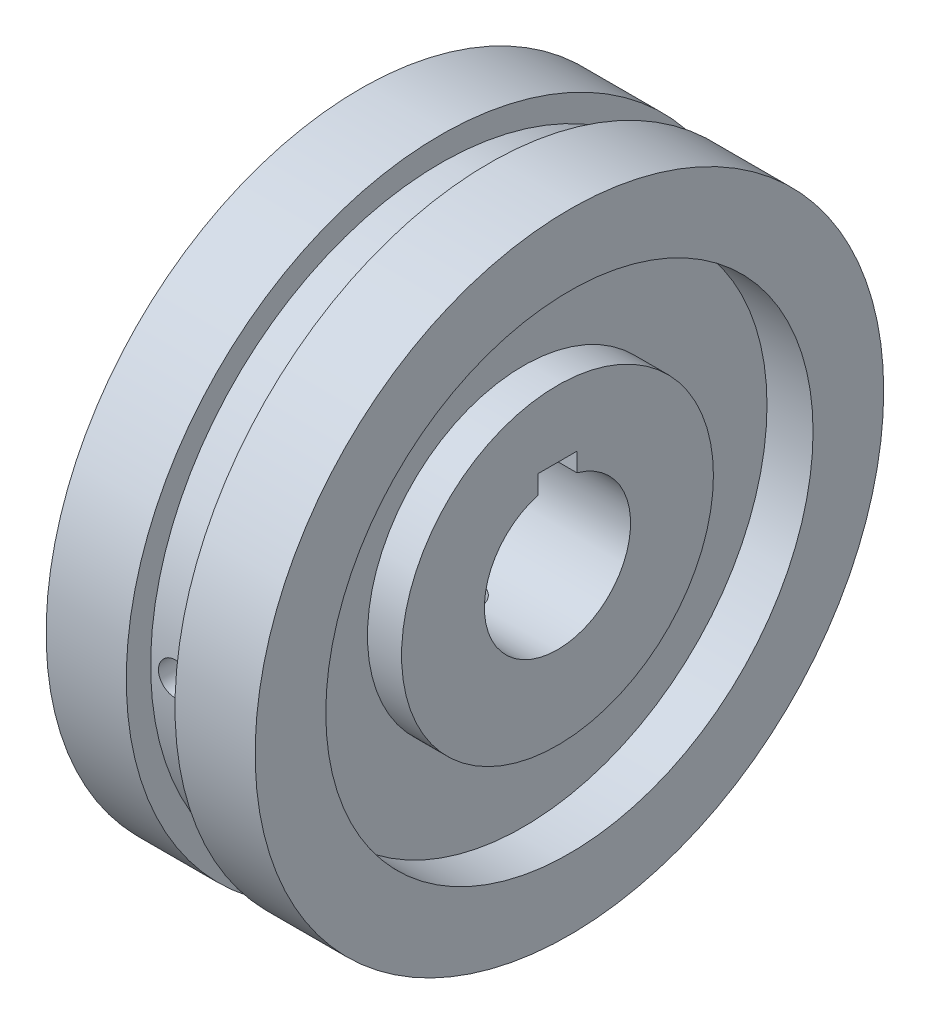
ISO-10303-21;
HEADER;
FILE_DESCRIPTION(('STEP AP214'),'2;1');
FILE_NAME('part.step','',(''),(''),'','','');
FILE_SCHEMA(('AUTOMOTIVE_DESIGN { 1 0 10303 214 1 1 1 1 }'));
ENDSEC;
DATA;
#1=APPLICATION_CONTEXT('core data for automotive mechanical design processes');
#2=APPLICATION_PROTOCOL_DEFINITION('international standard','automotive_design',2000,#1);
#3=PRODUCT_CONTEXT('',#1,'mechanical');
#4=PRODUCT('Part','Part','',(#3));
#5=PRODUCT_RELATED_PRODUCT_CATEGORY('part','',(#4));
#6=PRODUCT_DEFINITION_FORMATION('','',#4);
#7=PRODUCT_DEFINITION_CONTEXT('part definition',#1,'design');
#8=PRODUCT_DEFINITION('design','',#6,#7);
#9=PRODUCT_DEFINITION_SHAPE('','',#8);
#10=(LENGTH_UNIT() NAMED_UNIT(*) SI_UNIT(.MILLI.,.METRE.));
#11=(NAMED_UNIT(*) PLANE_ANGLE_UNIT() SI_UNIT($,.RADIAN.));
#12=(NAMED_UNIT(*) SI_UNIT($,.STERADIAN.) SOLID_ANGLE_UNIT());
#13=UNCERTAINTY_MEASURE_WITH_UNIT(LENGTH_MEASURE(1.E-05),#10,'distance_accuracy_value','');
#14=(GEOMETRIC_REPRESENTATION_CONTEXT(3) GLOBAL_UNCERTAINTY_ASSIGNED_CONTEXT((#13)) GLOBAL_UNIT_ASSIGNED_CONTEXT((#10,
#11,#12)) REPRESENTATION_CONTEXT('',''));
#15=CARTESIAN_POINT('',(0.,0.,0.));
#16=DIRECTION('',(0.,0.,1.));
#17=DIRECTION('',(1.,0.,0.));
#18=AXIS2_PLACEMENT_3D('',#15,#16,#17);
#19=CARTESIAN_POINT('',(22.4457076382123,-1.11022302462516E-13,0.));
#20=DIRECTION('',(1.,0.,0.));
#21=DIRECTION('',(0.,0.,-1.00000000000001));
#22=AXIS2_PLACEMENT_3D('',#19,#20,#21);
#23=CYLINDRICAL_SURFACE('',#22,32.);
#24=CARTESIAN_POINT('',(-19.,0.,0.));
#25=DIRECTION('',(1.,0.,0.));
#26=DIRECTION('',(0.,0.,-1.00000000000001));
#27=AXIS2_PLACEMENT_3D('',#24,#25,#26);
#28=CIRCLE('',#27,32.);
#29=CARTESIAN_POINT('',(-19.,0.,-32.0000000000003));
#30=VERTEX_POINT('',#29);
#31=EDGE_CURVE('E118',#30,#30,#28,.T.);
#32=ORIENTED_EDGE('',*,*,#31,.T.);
#33=EDGE_LOOP('',(#32));
#34=FACE_BOUND('',#33,.T.);
#35=CARTESIAN_POINT('',(-12.,0.,0.));
#36=DIRECTION('',(1.,0.,0.));
#37=DIRECTION('',(0.,0.,-1.00000000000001));
#38=AXIS2_PLACEMENT_3D('',#35,#36,#37);
#39=CIRCLE('',#38,32.);
#40=CARTESIAN_POINT('',(-12.,0.,-32.0000000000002));
#41=VERTEX_POINT('',#40);
#42=EDGE_CURVE('E175',#41,#41,#39,.T.);
#43=ORIENTED_EDGE('',*,*,#42,.F.);
#44=EDGE_LOOP('',(#43));
#45=FACE_BOUND('',#44,.T.);
#46=ADVANCED_FACE('F46',(#34,#45),#23,.T.);
#47=CARTESIAN_POINT('',(-12.,50.,-2.22044604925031E-13));
#48=DIRECTION('',(-1.,0.,0.));
#49=DIRECTION('',(0.,0.,1.00000000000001));
#50=AXIS2_PLACEMENT_3D('',#47,#48,#49);
#51=PLANE('',#50);
#52=ORIENTED_EDGE('',*,*,#42,.T.);
#53=EDGE_LOOP('',(#52));
#54=FACE_BOUND('',#53,.T.);
#55=CARTESIAN_POINT('',(-12.,0.,0.));
#56=DIRECTION('',(1.,0.,0.));
#57=DIRECTION('',(0.,0.,-1.00000000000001));
#58=AXIS2_PLACEMENT_3D('',#55,#56,#57);
#59=CIRCLE('',#58,50.);
#60=CARTESIAN_POINT('',(-12.,0.,-50.0000000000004));
#61=VERTEX_POINT('',#60);
#62=EDGE_CURVE('E171',#61,#61,#59,.T.);
#63=ORIENTED_EDGE('',*,*,#62,.F.);
#64=EDGE_LOOP('',(#63));
#65=FACE_BOUND('',#64,.T.);
#66=ADVANCED_FACE('F277',(#54,#65),#51,.T.);
#67=CARTESIAN_POINT('',(22.4457076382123,-1.11022302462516E-13,0.));
#68=DIRECTION('',(1.,0.,0.));
#69=DIRECTION('',(0.,0.,-1.00000000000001));
#70=AXIS2_PLACEMENT_3D('',#67,#68,#69);
#71=CYLINDRICAL_SURFACE('',#70,50.);
#72=ORIENTED_EDGE('',*,*,#62,.T.);
#73=EDGE_LOOP('',(#72));
#74=FACE_BOUND('',#73,.T.);
#75=CARTESIAN_POINT('',(-21.45,0.,-2.22044604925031E-13));
#76=DIRECTION('',(1.,0.,0.));
#77=DIRECTION('',(0.,0.,-1.00000000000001));
#78=AXIS2_PLACEMENT_3D('',#75,#76,#77);
#79=CIRCLE('',#78,50.);
#80=CARTESIAN_POINT('',(-21.45,0.,-50.0000000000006));
#81=VERTEX_POINT('',#80);
#82=EDGE_CURVE('E168',#81,#81,#79,.T.);
#83=ORIENTED_EDGE('',*,*,#82,.F.);
#84=EDGE_LOOP('',(#83));
#85=FACE_BOUND('',#84,.T.);
#86=ADVANCED_FACE('F282',(#74,#85),#71,.F.);
#87=CARTESIAN_POINT('',(-21.45,50.,-2.22044604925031E-13));
#88=DIRECTION('',(-1.,0.,0.));
#89=DIRECTION('',(0.,0.,1.00000000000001));
#90=AXIS2_PLACEMENT_3D('',#87,#88,#89);
#91=PLANE('',#90);
#92=ORIENTED_EDGE('',*,*,#82,.T.);
#93=EDGE_LOOP('',(#92));
#94=FACE_BOUND('',#93,.T.);
#95=CARTESIAN_POINT('',(-21.45,0.,-2.22044604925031E-13));
#96=DIRECTION('',(1.,0.,0.));
#97=DIRECTION('',(0.,0.,-1.00000000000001));
#98=AXIS2_PLACEMENT_3D('',#95,#96,#97);
#99=CIRCLE('',#98,64.5);
#100=CARTESIAN_POINT('',(-21.45,0.,-64.5000000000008));
#101=VERTEX_POINT('',#100);
#102=EDGE_CURVE('E164',#101,#101,#99,.T.);
#103=ORIENTED_EDGE('',*,*,#102,.F.);
#104=EDGE_LOOP('',(#103));
#105=FACE_BOUND('',#104,.T.);
#106=ADVANCED_FACE('F292',(#94,#105),#91,.T.);
#107=CARTESIAN_POINT('',(22.4457076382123,-1.11022302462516E-13,0.));
#108=DIRECTION('',(1.,0.,0.));
#109=DIRECTION('',(0.,0.,-1.00000000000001));
#110=AXIS2_PLACEMENT_3D('',#107,#108,#109);
#111=CYLINDRICAL_SURFACE('',#110,64.5);
#112=ORIENTED_EDGE('',*,*,#102,.T.);
#113=EDGE_LOOP('',(#112));
#114=FACE_BOUND('',#113,.T.);
#115=CARTESIAN_POINT('',(-5.,0.,0.));
#116=DIRECTION('',(1.,0.,0.));
#117=DIRECTION('',(0.,0.,-1.00000000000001));
#118=AXIS2_PLACEMENT_3D('',#115,#116,#117);
#119=CIRCLE('',#118,64.5);
#120=CARTESIAN_POINT('',(-5.,0.,-64.5000000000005));
#121=VERTEX_POINT('',#120);
#122=EDGE_CURVE('E160',#121,#121,#119,.T.);
#123=ORIENTED_EDGE('',*,*,#122,.F.);
#124=EDGE_LOOP('',(#123));
#125=FACE_BOUND('',#124,.T.);
#126=ADVANCED_FACE('F298',(#114,#125),#111,.T.);
#127=CARTESIAN_POINT('',(-5.,59.5000000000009,-6.66133814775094E-13));
#128=DIRECTION('',(1.,0.,0.));
#129=DIRECTION('',(0.,0.,-1.00000000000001));
#130=AXIS2_PLACEMENT_3D('',#127,#128,#129);
#131=PLANE('',#130);
#132=ORIENTED_EDGE('',*,*,#122,.T.);
#133=EDGE_LOOP('',(#132));
#134=FACE_BOUND('',#133,.T.);
#135=CARTESIAN_POINT('',(-5.,0.,0.));
#136=DIRECTION('',(1.,0.,0.));
#137=DIRECTION('',(0.,0.,-1.00000000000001));
#138=AXIS2_PLACEMENT_3D('',#135,#136,#137);
#139=CIRCLE('',#138,59.5);
#140=CARTESIAN_POINT('',(-5.,0.,-59.5000000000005));
#141=VERTEX_POINT('',#140);
#142=EDGE_CURVE('E156',#141,#141,#139,.T.);
#143=ORIENTED_EDGE('',*,*,#142,.F.);
#144=EDGE_LOOP('',(#143));
#145=FACE_BOUND('',#144,.T.);
#146=ADVANCED_FACE('F273',(#134,#145),#131,.T.);
#147=CARTESIAN_POINT('',(22.4457076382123,-1.11022302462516E-13,0.));
#148=DIRECTION('',(1.,0.,0.));
#149=DIRECTION('',(0.,0.,-1.00000000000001));
#150=AXIS2_PLACEMENT_3D('',#147,#148,#149);
#151=CYLINDRICAL_SURFACE('',#150,59.5);
#152=CARTESIAN_POINT('',(0.,-59.4027777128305,-3.40000000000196));
#153=CARTESIAN_POINT('',(0.190812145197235,-59.4027790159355,-3.39999159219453));
#154=CARTESIAN_POINT('',(0.381758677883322,-59.4037069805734,-3.38388311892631));
#155=CARTESIAN_POINT('',(0.758381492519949,-59.4073191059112,-3.31985319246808));
#156=CARTESIAN_POINT('',(0.944051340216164,-59.4100053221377,-3.27189450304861));
#157=CARTESIAN_POINT('',(1.30461069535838,-59.4168286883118,-3.14554416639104));
#158=CARTESIAN_POINT('',(1.47950574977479,-59.4209650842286,-3.06716833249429));
#159=CARTESIAN_POINT('',(1.81361097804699,-59.4302217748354,-2.88223350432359));
#160=CARTESIAN_POINT('',(1.97282478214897,-59.4353418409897,-2.77568105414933));
#161=CARTESIAN_POINT('',(2.27129820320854,-59.4459963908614,-2.53726729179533));
#162=CARTESIAN_POINT('',(2.41053516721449,-59.4515313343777,-2.40537763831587));
#163=CARTESIAN_POINT('',(2.66490890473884,-59.4623876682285,-2.12009111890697));
#164=CARTESIAN_POINT('',(2.78004468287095,-59.4677090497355,-1.96669336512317));
#165=CARTESIAN_POINT('',(2.98301430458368,-59.4775424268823,-1.64262112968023));
#166=CARTESIAN_POINT('',(3.07082987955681,-59.4820538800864,-1.47193518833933));
#167=CARTESIAN_POINT('',(3.21654925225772,-59.4897542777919,-1.11821223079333));
#168=CARTESIAN_POINT('',(3.27445332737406,-59.4929432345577,-0.935175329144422));
#169=CARTESIAN_POINT('',(3.35864446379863,-59.4976361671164,-0.562160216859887));
#170=CARTESIAN_POINT('',(3.38496632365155,-59.4991419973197,-0.372189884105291));
#171=CARTESIAN_POINT('',(3.40535328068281,-59.500305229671,0.00947833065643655));
#172=CARTESIAN_POINT('',(3.39941869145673,-59.4999626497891,0.201176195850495));
#173=CARTESIAN_POINT('',(3.35548999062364,-59.4974692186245,0.580622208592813));
#174=CARTESIAN_POINT('',(3.31753332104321,-59.4953204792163,0.768374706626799));
#175=CARTESIAN_POINT('',(3.21069598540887,-59.4894591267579,1.13483892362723));
#176=CARTESIAN_POINT('',(3.14181516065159,-59.4857465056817,1.31355059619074));
#177=CARTESIAN_POINT('',(2.97504225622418,-59.4771718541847,1.65698056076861));
#178=CARTESIAN_POINT('',(2.87713316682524,-59.4723091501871,1.82169057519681));
#179=CARTESIAN_POINT('',(2.65509540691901,-59.4619817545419,2.13235128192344));
#180=CARTESIAN_POINT('',(2.53096649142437,-59.4565170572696,2.27830179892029));
#181=CARTESIAN_POINT('',(2.25980108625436,-59.4455916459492,2.54751896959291));
#182=CARTESIAN_POINT('',(2.11273210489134,-59.440130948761,2.67075289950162));
#183=CARTESIAN_POINT('',(1.79997529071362,-59.4298369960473,2.89078653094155));
#184=CARTESIAN_POINT('',(1.63428745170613,-59.4250037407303,2.98758622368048));
#185=CARTESIAN_POINT('',(1.28897586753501,-59.4165103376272,3.15200102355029));
#186=CARTESIAN_POINT('',(1.10935149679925,-59.4128502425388,3.21961481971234));
#187=CARTESIAN_POINT('',(0.741274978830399,-59.4071178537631,3.32371626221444));
#188=CARTESIAN_POINT('',(0.552822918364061,-59.4050455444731,3.36020421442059));
#189=CARTESIAN_POINT('',(0.172725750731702,-59.4027253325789,3.40097757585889));
#190=CARTESIAN_POINT('',(-0.0189144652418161,-59.4024748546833,3.40530844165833));
#191=CARTESIAN_POINT('',(-0.400198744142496,-59.4038198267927,3.38176339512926));
#192=CARTESIAN_POINT('',(-0.589842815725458,-59.4054152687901,3.3538876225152));
#193=CARTESIAN_POINT('',(-0.961623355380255,-59.4102699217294,3.26675832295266));
#194=CARTESIAN_POINT('',(-1.14376473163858,-59.4135280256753,3.20752567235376));
#195=CARTESIAN_POINT('',(-1.49552091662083,-59.4213398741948,3.05938515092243));
#196=CARTESIAN_POINT('',(-1.6651356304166,-59.4258936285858,2.97047705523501));
#197=CARTESIAN_POINT('',(-1.98723270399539,-59.4357898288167,2.76539302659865));
#198=CARTESIAN_POINT('',(-2.13969562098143,-59.4411331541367,2.64918660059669));
#199=CARTESIAN_POINT('',(-2.42296550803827,-59.4520032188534,2.39284904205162));
#200=CARTESIAN_POINT('',(-2.55377229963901,-59.4575299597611,2.25271771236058));
#201=CARTESIAN_POINT('',(-2.79016999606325,-59.468151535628,1.95231270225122));
#202=CARTESIAN_POINT('',(-2.89573150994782,-59.4732458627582,1.79201587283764));
#203=CARTESIAN_POINT('',(-3.07844111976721,-59.4824212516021,1.45594677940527));
#204=CARTESIAN_POINT('',(-3.15558936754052,-59.4865023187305,1.2801745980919));
#205=CARTESIAN_POINT('',(-3.27923124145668,-59.4931888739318,0.918252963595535));
#206=CARTESIAN_POINT('',(-3.32574356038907,-59.4957952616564,0.732109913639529));
#207=CARTESIAN_POINT('',(-3.38685445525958,-59.4992423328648,0.354641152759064));
#208=CARTESIAN_POINT('',(-3.40145328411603,-59.5000830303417,0.163315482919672));
#209=CARTESIAN_POINT('',(-3.39832038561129,-59.4999040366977,-0.218796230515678));
#210=CARTESIAN_POINT('',(-3.38063470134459,-59.4988869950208,-0.409582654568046));
#211=CARTESIAN_POINT('',(-3.313530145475,-59.4951121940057,-0.78547257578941));
#212=CARTESIAN_POINT('',(-3.26411121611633,-59.4923544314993,-0.970576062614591));
#213=CARTESIAN_POINT('',(-3.13495298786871,-59.4854082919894,-1.32985374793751));
#214=CARTESIAN_POINT('',(-3.05521368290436,-59.4812199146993,-1.5040279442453));
#215=CARTESIAN_POINT('',(-2.86768518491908,-59.4718831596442,-1.83652126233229));
#216=CARTESIAN_POINT('',(-2.75989678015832,-59.4667348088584,-1.99484082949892));
#217=CARTESIAN_POINT('',(-2.51916150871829,-59.4560487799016,-2.29136304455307));
#218=CARTESIAN_POINT('',(-2.38618178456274,-59.4505105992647,-2.4295389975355));
#219=CARTESIAN_POINT('',(-2.09887477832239,-59.4396728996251,-2.68165143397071));
#220=CARTESIAN_POINT('',(-1.94454226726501,-59.4343734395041,-2.79558196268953));
#221=CARTESIAN_POINT('',(-1.61875940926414,-59.4246065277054,-2.99603967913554));
#222=CARTESIAN_POINT('',(-1.44729021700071,-59.4201400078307,-3.082536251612));
#223=CARTESIAN_POINT('',(-1.09236391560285,-59.4125568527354,-3.22540771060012));
#224=CARTESIAN_POINT('',(-0.90892118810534,-59.409438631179,-3.28181801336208));
#225=CARTESIAN_POINT('',(-0.603623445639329,-59.4057255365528,-3.3481924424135));
#226=CARTESIAN_POINT('',(-0.483743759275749,-59.4046250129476,-3.36759529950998));
#227=CARTESIAN_POINT('',(-0.242594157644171,-59.4031506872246,-3.39350174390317));
#228=CARTESIAN_POINT('',(-0.12132424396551,-59.4027768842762,-3.4000053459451));
#229=CARTESIAN_POINT('',(0.,-59.4027777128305,-3.40000000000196));
#230=B_SPLINE_CURVE_WITH_KNOTS('',3,(#152,#153,#154,#155,#156,#157,#158,#159,#160,#161,#162,
#163,#164,#165,#166,#167,#168,#169,#170,#171,#172,#173,#174,#175,#176,#177,#178,#179,#180,#181,
#182,#183,#184,#185,#186,#187,#188,#189,#190,#191,#192,#193,#194,#195,#196,#197,#198,#199,#200,
#201,#202,#203,#204,#205,#206,#207,#208,#209,#210,#211,#212,#213,#214,#215,#216,#217,#218,#219,
#220,#221,#222,#223,#224,#225,#226,#227,#228,#229),.UNSPECIFIED.,.T.,.F.,(4,2,2,2,2,2,2,2,2,2,2,
2,2,2,2,2,2,2,2,2,2,2,2,2,2,2,2,2,2,2,2,2,2,2,2,2,2,2,4),(0.,0.571993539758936,1.14465697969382,
1.71702309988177,2.28925640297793,2.86213355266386,3.43503435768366,4.00831743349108,
4.58159519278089,5.15424070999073,5.72688065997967,6.29885197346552,6.87082622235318,
7.4431362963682,8.01545171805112,8.58858523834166,9.16171894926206,9.73487840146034,
10.3080322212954,10.8803756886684,11.4527166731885,12.0246770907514,12.5966418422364,
13.169248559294,13.7418599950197,14.3151348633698,14.8884066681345,15.4613283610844,
16.0342455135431,16.6063462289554,17.1784479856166,17.7505498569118,18.3226356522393,
18.8954728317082,19.4684505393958,20.0420654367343,20.6150036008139,20.9786951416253,
21.3423862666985),.UNSPECIFIED.);
#231=CARTESIAN_POINT('',(0.,-59.4027777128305,-3.40000000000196));
#232=VERTEX_POINT('',#231);
#233=EDGE_CURVE('E187',#232,#232,#230,.T.);
#234=ORIENTED_EDGE('',*,*,#233,.F.);
#235=EDGE_LOOP('',(#234));
#236=FACE_BOUND('',#235,.T.);
#237=CARTESIAN_POINT('',(0.,-3.39999999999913,59.4027777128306));
#238=CARTESIAN_POINT('',(0.190812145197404,-3.39999159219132,59.4027790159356));
#239=CARTESIAN_POINT('',(0.381758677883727,-3.38388311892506,59.4037069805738));
#240=CARTESIAN_POINT('',(0.758381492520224,-3.31985319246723,59.4073191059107));
#241=CARTESIAN_POINT('',(0.944051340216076,-3.27189450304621,59.4100053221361));
#242=CARTESIAN_POINT('',(1.30461069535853,-3.14554416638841,59.4168286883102));
#243=CARTESIAN_POINT('',(1.47950574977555,-3.06716833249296,59.4209650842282));
#244=CARTESIAN_POINT('',(1.81361097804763,-2.88223350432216,59.4302217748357));
#245=CARTESIAN_POINT('',(1.9728247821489,-2.7756810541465,59.4353418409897));
#246=CARTESIAN_POINT('',(2.27129820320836,-2.53726729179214,59.4459963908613));
#247=CARTESIAN_POINT('',(2.41053516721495,-2.40537763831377,59.4515313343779));
#248=CARTESIAN_POINT('',(2.6649089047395,-2.12009111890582,59.4623876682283));
#249=CARTESIAN_POINT('',(2.78004468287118,-1.9666933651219,59.4677090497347));
#250=CARTESIAN_POINT('',(2.9830143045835,-1.6426211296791,59.4775424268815));
#251=CARTESIAN_POINT('',(3.07082987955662,-1.47193518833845,59.4820538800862));
#252=CARTESIAN_POINT('',(3.21654925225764,-1.11821223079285,59.4897542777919));
#253=CARTESIAN_POINT('',(3.27445332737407,-0.93517532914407,59.4929432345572));
#254=CARTESIAN_POINT('',(3.35864446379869,-0.562160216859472,59.4976361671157));
#255=CARTESIAN_POINT('',(3.38496632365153,-0.37218988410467,59.4991419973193));
#256=CARTESIAN_POINT('',(3.40535328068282,0.00947833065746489,59.5003052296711));
#257=CARTESIAN_POINT('',(3.39941869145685,0.201176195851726,59.4999626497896));
#258=CARTESIAN_POINT('',(3.35548999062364,0.580622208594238,59.4974692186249));
#259=CARTESIAN_POINT('',(3.317533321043,0.768374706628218,59.4953204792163));
#260=CARTESIAN_POINT('',(3.21069598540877,1.1348389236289,59.4894591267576));
#261=CARTESIAN_POINT('',(3.14181516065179,1.31355059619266,59.4857465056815));
#262=CARTESIAN_POINT('',(2.97504225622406,1.65698056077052,59.4771718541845));
#263=CARTESIAN_POINT('',(2.87713316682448,1.82169057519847,59.4723091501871));
#264=CARTESIAN_POINT('',(2.65509540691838,2.13235128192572,59.4619817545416));
#265=CARTESIAN_POINT('',(2.53096649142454,2.27830179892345,59.4565170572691));
#266=CARTESIAN_POINT('',(2.25980108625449,2.54751896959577,59.4455916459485));
#267=CARTESIAN_POINT('',(2.11273210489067,2.67075289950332,59.4401309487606));
#268=CARTESIAN_POINT('',(1.79997529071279,2.8907865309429,59.4298369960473));
#269=CARTESIAN_POINT('',(1.63428745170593,2.98758622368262,59.4250037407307));
#270=CARTESIAN_POINT('',(1.28897586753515,3.1520010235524,59.4165103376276));
#271=CARTESIAN_POINT('',(1.10935149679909,3.2196148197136,59.412850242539));
#272=CARTESIAN_POINT('',(0.741274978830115,3.32371626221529,59.4071178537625));
#273=CARTESIAN_POINT('',(0.552822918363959,3.36020421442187,59.4050455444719));
#274=CARTESIAN_POINT('',(0.172725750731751,3.40097757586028,59.402725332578));
#275=CARTESIAN_POINT('',(-0.0189144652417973,3.40530844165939,59.4024748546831));
#276=CARTESIAN_POINT('',(-0.400198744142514,3.3817633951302,59.4038198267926));
#277=CARTESIAN_POINT('',(-0.589842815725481,3.35388762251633,59.4054152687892));
#278=CARTESIAN_POINT('',(-0.961623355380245,3.26675832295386,59.4102699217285));
#279=CARTESIAN_POINT('',(-1.14376473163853,3.20752567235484,59.4135280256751));
#280=CARTESIAN_POINT('',(-1.49552091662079,3.05938515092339,59.4213398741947));
#281=CARTESIAN_POINT('',(-1.6651356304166,2.97047705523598,59.4258936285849));
#282=CARTESIAN_POINT('',(-1.98723270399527,2.76539302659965,59.4357898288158));
#283=CARTESIAN_POINT('',(-2.13969562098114,2.64918660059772,59.4411331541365));
#284=CARTESIAN_POINT('',(-2.42296550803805,2.39284904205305,59.4520032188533));
#285=CARTESIAN_POINT('',(-2.55377229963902,2.25271771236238,59.4575299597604));
#286=CARTESIAN_POINT('',(-2.79016999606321,1.95231270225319,59.4681515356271));
#287=CARTESIAN_POINT('',(-2.89573150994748,1.79201587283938,59.4732458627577));
#288=CARTESIAN_POINT('',(-3.07844111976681,1.45594677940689,59.4824212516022));
#289=CARTESIAN_POINT('',(-3.15558936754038,1.28017459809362,59.4865023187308));
#290=CARTESIAN_POINT('',(-3.27923124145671,0.918252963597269,59.4931888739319));
#291=CARTESIAN_POINT('',(-3.325743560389,0.732109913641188,59.4957952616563));
#292=CARTESIAN_POINT('',(-3.38685445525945,0.354641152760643,59.4992423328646));
#293=CARTESIAN_POINT('',(-3.40145328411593,0.163315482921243,59.500083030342));
#294=CARTESIAN_POINT('',(-3.39832038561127,-0.218796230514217,59.499904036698));
#295=CARTESIAN_POINT('',(-3.38063470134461,-0.40958265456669,59.4988869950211));
#296=CARTESIAN_POINT('',(-3.31353014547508,-0.785472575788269,59.4951121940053));
#297=CARTESIAN_POINT('',(-3.26411121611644,-0.970576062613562,59.4923544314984));
#298=CARTESIAN_POINT('',(-3.13495298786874,-1.32985374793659,59.4854082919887));
#299=CARTESIAN_POINT('',(-3.05521368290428,-1.50402794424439,59.4812199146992));
#300=CARTESIAN_POINT('',(-2.86768518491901,-1.83652126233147,59.4718831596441));
#301=CARTESIAN_POINT('',(-2.75989678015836,-1.9948408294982,59.4667348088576));
#302=CARTESIAN_POINT('',(-2.51916150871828,-2.29136304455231,59.4560487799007));
#303=CARTESIAN_POINT('',(-2.38618178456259,-2.42953899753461,59.4505105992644));
#304=CARTESIAN_POINT('',(-2.09887477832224,-2.68165143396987,59.4396728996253));
#305=CARTESIAN_POINT('',(-1.944542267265,-2.79558196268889,59.4343734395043));
#306=CARTESIAN_POINT('',(-1.61875940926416,-2.99603967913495,59.4246065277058));
#307=CARTESIAN_POINT('',(-1.44729021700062,-3.08253625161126,59.4201400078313));
#308=CARTESIAN_POINT('',(-1.09236391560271,-3.22540771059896,59.4125568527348));
#309=CARTESIAN_POINT('',(-0.908921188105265,-3.28181801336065,59.409438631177));
#310=CARTESIAN_POINT('',(-0.603623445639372,-3.34819244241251,59.4057255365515));
#311=CARTESIAN_POINT('',(-0.483743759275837,-3.36759529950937,59.4046250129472));
#312=CARTESIAN_POINT('',(-0.242594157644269,-3.39350174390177,59.4031506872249));
#313=CARTESIAN_POINT('',(-0.121324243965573,-3.40000534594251,59.4027768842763));
#314=CARTESIAN_POINT('',(0.,-3.39999999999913,59.4027777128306));
#315=B_SPLINE_CURVE_WITH_KNOTS('',3,(#237,#238,#239,#240,#241,#242,#243,#244,#245,#246,#247,
#248,#249,#250,#251,#252,#253,#254,#255,#256,#257,#258,#259,#260,#261,#262,#263,#264,#265,#266,
#267,#268,#269,#270,#271,#272,#273,#274,#275,#276,#277,#278,#279,#280,#281,#282,#283,#284,#285,
#286,#287,#288,#289,#290,#291,#292,#293,#294,#295,#296,#297,#298,#299,#300,#301,#302,#303,#304,
#305,#306,#307,#308,#309,#310,#311,#312,#313,#314),.UNSPECIFIED.,.T.,.F.,(4,2,2,2,2,2,2,2,2,2,2,
2,2,2,2,2,2,2,2,2,2,2,2,2,2,2,2,2,2,2,2,2,2,2,2,2,2,2,4),(0.,0.571993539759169,1.14465697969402,
1.71702309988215,2.28925640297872,2.86213355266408,3.43503435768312,4.00831743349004,
4.58159519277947,5.15424070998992,5.7268806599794,6.29885197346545,6.87082622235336,
7.44313629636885,8.01545171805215,8.58858523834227,9.16171894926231,9.73487840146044,
10.3080322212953,10.8803756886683,11.4527166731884,12.0246770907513,12.5966418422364,
13.1692485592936,13.741859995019,14.315134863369,14.8884066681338,15.4613283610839,
16.0342455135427,16.6063462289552,17.1784479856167,17.7505498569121,18.3226356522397,
18.8954728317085,19.4684505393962,20.0420654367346,20.6150036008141,20.9786951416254,
21.3423862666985),.UNSPECIFIED.);
#316=CARTESIAN_POINT('',(0.,-3.39999999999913,59.4027777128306));
#317=VERTEX_POINT('',#316);
#318=EDGE_CURVE('E103',#317,#317,#315,.T.);
#319=ORIENTED_EDGE('',*,*,#318,.F.);
#320=EDGE_LOOP('',(#319));
#321=FACE_BOUND('',#320,.T.);
#322=ORIENTED_EDGE('',*,*,#142,.T.);
#323=EDGE_LOOP('',(#322));
#324=FACE_BOUND('',#323,.T.);
#325=CARTESIAN_POINT('',(5.,0.,-2.22044604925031E-13));
#326=DIRECTION('',(1.,0.,0.));
#327=DIRECTION('',(0.,0.,-1.00000000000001));
#328=AXIS2_PLACEMENT_3D('',#325,#326,#327);
#329=CIRCLE('',#328,59.5);
#330=CARTESIAN_POINT('',(5.,0.,-59.5000000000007));
#331=VERTEX_POINT('',#330);
#332=EDGE_CURVE('E152',#331,#331,#329,.T.);
#333=ORIENTED_EDGE('',*,*,#332,.F.);
#334=EDGE_LOOP('',(#333));
#335=FACE_BOUND('',#334,.T.);
#336=ADVANCED_FACE('F212',(#236,#321,#324,#335),#151,.T.);
#337=CARTESIAN_POINT('',(5.,59.5000000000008,-8.88178419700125E-13));
#338=DIRECTION('',(-1.,0.,0.));
#339=DIRECTION('',(0.,0.,1.00000000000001));
#340=AXIS2_PLACEMENT_3D('',#337,#338,#339);
#341=PLANE('',#340);
#342=ORIENTED_EDGE('',*,*,#332,.T.);
#343=EDGE_LOOP('',(#342));
#344=FACE_BOUND('',#343,.T.);
#345=CARTESIAN_POINT('',(5.,0.,-2.22044604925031E-13));
#346=DIRECTION('',(1.,0.,0.));
#347=DIRECTION('',(0.,0.,-1.00000000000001));
#348=AXIS2_PLACEMENT_3D('',#345,#346,#347);
#349=CIRCLE('',#348,64.5);
#350=CARTESIAN_POINT('',(5.,0.,-64.5000000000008));
#351=VERTEX_POINT('',#350);
#352=EDGE_CURVE('E148',#351,#351,#349,.T.);
#353=ORIENTED_EDGE('',*,*,#352,.F.);
#354=EDGE_LOOP('',(#353));
#355=FACE_BOUND('',#354,.T.);
#356=ADVANCED_FACE('F266',(#344,#355),#341,.T.);
#357=CARTESIAN_POINT('',(22.4457076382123,-1.11022302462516E-13,0.));
#358=DIRECTION('',(1.,0.,0.));
#359=DIRECTION('',(0.,0.,-1.00000000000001));
#360=AXIS2_PLACEMENT_3D('',#357,#358,#359);
#361=CYLINDRICAL_SURFACE('',#360,64.5);
#362=ORIENTED_EDGE('',*,*,#352,.T.);
#363=EDGE_LOOP('',(#362));
#364=FACE_BOUND('',#363,.T.);
#365=CARTESIAN_POINT('',(21.45,0.,0.));
#366=DIRECTION('',(1.,0.,0.));
#367=DIRECTION('',(0.,0.,-1.00000000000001));
#368=AXIS2_PLACEMENT_3D('',#365,#366,#367);
#369=CIRCLE('',#368,64.5);
#370=CARTESIAN_POINT('',(21.45,0.,-64.5000000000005));
#371=VERTEX_POINT('',#370);
#372=EDGE_CURVE('E144',#371,#371,#369,.T.);
#373=ORIENTED_EDGE('',*,*,#372,.F.);
#374=EDGE_LOOP('',(#373));
#375=FACE_BOUND('',#374,.T.);
#376=ADVANCED_FACE('F263',(#364,#375),#361,.T.);
#377=CARTESIAN_POINT('',(21.45,50.0000000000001,-2.22044604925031E-13));
#378=DIRECTION('',(1.,0.,0.));
#379=DIRECTION('',(0.,0.,-1.00000000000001));
#380=AXIS2_PLACEMENT_3D('',#377,#378,#379);
#381=PLANE('',#380);
#382=ORIENTED_EDGE('',*,*,#372,.T.);
#383=EDGE_LOOP('',(#382));
#384=FACE_BOUND('',#383,.T.);
#385=CARTESIAN_POINT('',(21.45,0.,0.));
#386=DIRECTION('',(1.,0.,0.));
#387=DIRECTION('',(0.,0.,-1.00000000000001));
#388=AXIS2_PLACEMENT_3D('',#385,#386,#387);
#389=CIRCLE('',#388,50.);
#390=CARTESIAN_POINT('',(21.45,0.,-50.0000000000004));
#391=VERTEX_POINT('',#390);
#392=EDGE_CURVE('E140',#391,#391,#389,.T.);
#393=ORIENTED_EDGE('',*,*,#392,.F.);
#394=EDGE_LOOP('',(#393));
#395=FACE_BOUND('',#394,.T.);
#396=ADVANCED_FACE('F259',(#384,#395),#381,.T.);
#397=CARTESIAN_POINT('',(22.4457076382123,-1.11022302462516E-13,0.));
#398=DIRECTION('',(1.,0.,0.));
#399=DIRECTION('',(0.,0.,-1.00000000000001));
#400=AXIS2_PLACEMENT_3D('',#397,#398,#399);
#401=CYLINDRICAL_SURFACE('',#400,50.);
#402=ORIENTED_EDGE('',*,*,#392,.T.);
#403=EDGE_LOOP('',(#402));
#404=FACE_BOUND('',#403,.T.);
#405=CARTESIAN_POINT('',(12.,0.,-2.22044604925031E-13));
#406=DIRECTION('',(1.,0.,0.));
#407=DIRECTION('',(0.,0.,-1.00000000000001));
#408=AXIS2_PLACEMENT_3D('',#405,#406,#407);
#409=CIRCLE('',#408,50.);
#410=CARTESIAN_POINT('',(12.,0.,-50.0000000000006));
#411=VERTEX_POINT('',#410);
#412=EDGE_CURVE('E136',#411,#411,#409,.T.);
#413=ORIENTED_EDGE('',*,*,#412,.F.);
#414=EDGE_LOOP('',(#413));
#415=FACE_BOUND('',#414,.T.);
#416=ADVANCED_FACE('F255',(#404,#415),#401,.F.);
#417=CARTESIAN_POINT('',(12.,32.0000000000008,-5.55111512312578E-13));
#418=DIRECTION('',(1.,0.,0.));
#419=DIRECTION('',(0.,0.,-1.00000000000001));
#420=AXIS2_PLACEMENT_3D('',#417,#418,#419);
#421=PLANE('',#420);
#422=ORIENTED_EDGE('',*,*,#412,.T.);
#423=EDGE_LOOP('',(#422));
#424=FACE_BOUND('',#423,.T.);
#425=CARTESIAN_POINT('',(12.,0.,-2.22044604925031E-13));
#426=DIRECTION('',(1.,0.,0.));
#427=DIRECTION('',(0.,0.,-1.00000000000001));
#428=AXIS2_PLACEMENT_3D('',#425,#426,#427);
#429=CIRCLE('',#428,32.);
#430=CARTESIAN_POINT('',(12.,0.,-32.0000000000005));
#431=VERTEX_POINT('',#430);
#432=EDGE_CURVE('E132',#431,#431,#429,.T.);
#433=ORIENTED_EDGE('',*,*,#432,.F.);
#434=EDGE_LOOP('',(#433));
#435=FACE_BOUND('',#434,.T.);
#436=ADVANCED_FACE('F251',(#424,#435),#421,.T.);
#437=CARTESIAN_POINT('',(22.4457076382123,-1.11022302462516E-13,0.));
#438=DIRECTION('',(1.,0.,0.));
#439=DIRECTION('',(0.,0.,-1.00000000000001));
#440=AXIS2_PLACEMENT_3D('',#437,#438,#439);
#441=CYLINDRICAL_SURFACE('',#440,32.);
#442=ORIENTED_EDGE('',*,*,#432,.T.);
#443=EDGE_LOOP('',(#442));
#444=FACE_BOUND('',#443,.T.);
#445=CARTESIAN_POINT('',(19.,0.,-2.22044604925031E-13));
#446=DIRECTION('',(1.,0.,0.));
#447=DIRECTION('',(0.,0.,-1.00000000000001));
#448=AXIS2_PLACEMENT_3D('',#445,#446,#447);
#449=CIRCLE('',#448,32.);
#450=CARTESIAN_POINT('',(19.,0.,-32.0000000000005));
#451=VERTEX_POINT('',#450);
#452=EDGE_CURVE('E128',#451,#451,#449,.T.);
#453=ORIENTED_EDGE('',*,*,#452,.F.);
#454=EDGE_LOOP('',(#453));
#455=FACE_BOUND('',#454,.T.);
#456=ADVANCED_FACE('F248',(#444,#455),#441,.T.);
#457=CARTESIAN_POINT('',(19.,15.000000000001,-2.22044604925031E-13));
#458=DIRECTION('',(1.,0.,0.));
#459=DIRECTION('',(0.,0.,-1.00000000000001));
#460=AXIS2_PLACEMENT_3D('',#457,#458,#459);
#461=PLANE('',#460);
#462=DIRECTION('',(0.,-1.00000000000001,0.));
#463=VECTOR('',#462,1.);
#464=CARTESIAN_POINT('',(19.,15.0000000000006,3.99999999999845));
#465=LINE('',#464,#463);
#466=CARTESIAN_POINT('',(19.0000000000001,18.3000000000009,3.99999999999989));
#467=VERTEX_POINT('',#466);
#468=CARTESIAN_POINT('',(19.,14.4568322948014,3.99999999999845));
#469=VERTEX_POINT('',#468);
#470=EDGE_CURVE('E69',#467,#469,#465,.T.);
#471=ORIENTED_EDGE('',*,*,#470,.F.);
#472=DIRECTION('',(0.,0.,1.00000000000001));
#473=VECTOR('',#472,1.);
#474=CARTESIAN_POINT('',(19.,18.3000000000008,-1.11022302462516E-12));
#475=LINE('',#474,#473);
#476=CARTESIAN_POINT('',(19.0000000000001,18.3000000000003,-4.00000000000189));
#477=VERTEX_POINT('',#476);
#478=EDGE_CURVE('E94',#477,#467,#475,.T.);
#479=ORIENTED_EDGE('',*,*,#478,.F.);
#480=DIRECTION('',(0.,1.00000000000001,0.));
#481=VECTOR('',#480,1.);
#482=CARTESIAN_POINT('',(19.,15.0000000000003,-4.000000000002));
#483=LINE('',#482,#481);
#484=CARTESIAN_POINT('',(19.,14.4568322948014,-4.00000000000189));
#485=VERTEX_POINT('',#484);
#486=EDGE_CURVE('E85',#485,#477,#483,.T.);
#487=ORIENTED_EDGE('',*,*,#486,.F.);
#488=CARTESIAN_POINT('',(19.,0.,-2.22044604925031E-13));
#489=DIRECTION('',(1.,0.,0.));
#490=DIRECTION('',(0.,0.,-1.00000000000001));
#491=AXIS2_PLACEMENT_3D('',#488,#489,#490);
#492=CIRCLE('',#491,15.);
#493=EDGE_CURVE('E125',#469,#485,#492,.T.);
#494=ORIENTED_EDGE('',*,*,#493,.F.);
#495=EDGE_LOOP('',(#471,#479,#487,#494));
#496=FACE_BOUND('',#495,.T.);
#497=ORIENTED_EDGE('',*,*,#452,.T.);
#498=EDGE_LOOP('',(#497));
#499=FACE_BOUND('',#498,.T.);
#500=ADVANCED_FACE('F105',(#496,#499),#461,.T.);
#501=CARTESIAN_POINT('',(22.4457076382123,-1.11022302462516E-13,0.));
#502=DIRECTION('',(1.,0.,0.));
#503=DIRECTION('',(0.,0.,-1.00000000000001));
#504=AXIS2_PLACEMENT_3D('',#501,#502,#503);
#505=CYLINDRICAL_SURFACE('',#504,15.);
#506=CARTESIAN_POINT('',(0.,-14.6095858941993,-3.40000000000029));
#507=CARTESIAN_POINT('',(-0.188328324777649,-14.6095896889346,-3.39999376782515));
#508=CARTESIAN_POINT('',(-0.376730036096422,-14.6132671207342,-3.38429930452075));
#509=CARTESIAN_POINT('',(-0.748162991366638,-14.6275499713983,-3.32201232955));
#510=CARTESIAN_POINT('',(-0.931190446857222,-14.6381601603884,-3.27539854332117));
#511=CARTESIAN_POINT('',(-1.28644843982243,-14.66504652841,-3.15282654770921));
#512=CARTESIAN_POINT('',(-1.45869106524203,-14.6813162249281,-3.07690190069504));
#513=CARTESIAN_POINT('',(-1.78800144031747,-14.7176805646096,-2.89796109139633));
#514=CARTESIAN_POINT('',(-1.94506926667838,-14.7377751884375,-2.79494506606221));
#515=CARTESIAN_POINT('',(-2.24242004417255,-14.7799323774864,-2.5627542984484));
#516=CARTESIAN_POINT('',(-2.38238773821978,-14.8020216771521,-2.43318060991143));
#517=CARTESIAN_POINT('',(-2.63880009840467,-14.845445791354,-2.15241343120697));
#518=CARTESIAN_POINT('',(-2.75524285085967,-14.8667805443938,-2.00121818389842));
#519=CARTESIAN_POINT('',(-2.96255741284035,-14.9065840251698,-1.67937478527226));
#520=CARTESIAN_POINT('',(-3.05312441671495,-14.9250175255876,-1.50852556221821));
#521=CARTESIAN_POINT('',(-3.20414226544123,-14.9566388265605,-1.15354387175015));
#522=CARTESIAN_POINT('',(-3.26459674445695,-14.9698272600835,-0.969413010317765));
#523=CARTESIAN_POINT('',(-3.35267747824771,-14.9892835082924,-0.596375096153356));
#524=CARTESIAN_POINT('',(-3.38083775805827,-14.9956637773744,-0.407600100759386));
#525=CARTESIAN_POINT('',(-3.40520199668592,-15.0011749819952,-0.0279047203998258));
#526=CARTESIAN_POINT('',(-3.40140987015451,-15.0003068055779,0.1630153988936));
#527=CARTESIAN_POINT('',(-3.36237137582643,-14.9915043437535,0.537894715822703));
#528=CARTESIAN_POINT('',(-3.32770080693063,-14.9836994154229,0.721917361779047));
#529=CARTESIAN_POINT('',(-3.22880907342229,-14.9620485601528,1.08146229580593));
#530=CARTESIAN_POINT('',(-3.16458650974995,-14.9482023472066,1.25698418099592));
#531=CARTESIAN_POINT('',(-3.00791517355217,-14.9158191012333,1.59612379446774));
#532=CARTESIAN_POINT('',(-2.91525140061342,-14.8972465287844,1.75963866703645));
#533=CARTESIAN_POINT('',(-2.70448897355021,-14.8574418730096,2.06900575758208));
#534=CARTESIAN_POINT('',(-2.58638661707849,-14.836209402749,2.21485539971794));
#535=CARTESIAN_POINT('',(-2.32497600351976,-14.792855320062,2.48817919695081));
#536=CARTESIAN_POINT('',(-2.18116390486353,-14.7707244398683,2.61517044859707));
#537=CARTESIAN_POINT('',(-1.87405443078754,-14.7285093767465,2.84332790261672));
#538=CARTESIAN_POINT('',(-1.71075644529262,-14.7084252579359,2.94449329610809));
#539=CARTESIAN_POINT('',(-1.36849004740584,-14.6725508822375,3.11836423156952));
#540=CARTESIAN_POINT('',(-1.18947058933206,-14.6567753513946,3.19097253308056));
#541=CARTESIAN_POINT('',(-0.82132733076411,-14.6315040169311,3.30492553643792));
#542=CARTESIAN_POINT('',(-0.632205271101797,-14.6220071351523,3.34627560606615));
#543=CARTESIAN_POINT('',(-0.253653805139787,-14.6105898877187,3.39577685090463));
#544=CARTESIAN_POINT('',(-0.0643214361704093,-14.6085084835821,3.40463379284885));
#545=CARTESIAN_POINT('',(0.313114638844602,-14.6117224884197,3.39081335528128));
#546=CARTESIAN_POINT('',(0.501218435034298,-14.6170173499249,3.368138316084));
#547=CARTESIAN_POINT('',(0.868361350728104,-14.6342346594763,3.29251156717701));
#548=CARTESIAN_POINT('',(1.04748605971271,-14.6460707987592,3.23995388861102));
#549=CARTESIAN_POINT('',(1.39438627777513,-14.6749581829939,3.10648286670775));
#550=CARTESIAN_POINT('',(1.56216063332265,-14.6920099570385,3.0255666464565));
#551=CARTESIAN_POINT('',(1.88463646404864,-14.7297575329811,2.83613951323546));
#552=CARTESIAN_POINT('',(2.03907776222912,-14.7505086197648,2.72719692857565));
#553=CARTESIAN_POINT('',(2.32774591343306,-14.7931734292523,2.48536971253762));
#554=CARTESIAN_POINT('',(2.46197005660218,-14.8150873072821,2.35248187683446));
#555=CARTESIAN_POINT('',(2.70916196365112,-14.8581430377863,2.06333149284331));
#556=CARTESIAN_POINT('',(2.82164681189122,-14.8792604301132,1.90665183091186));
#557=CARTESIAN_POINT('',(3.01870081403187,-14.9178813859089,1.57621187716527));
#558=CARTESIAN_POINT('',(3.10327131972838,-14.9353851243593,1.40245241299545));
#559=CARTESIAN_POINT('',(3.24143786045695,-14.9647040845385,1.04390552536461));
#560=CARTESIAN_POINT('',(3.29523791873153,-14.9765566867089,0.859199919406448));
#561=CARTESIAN_POINT('',(3.37096847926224,-14.9934000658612,0.48307138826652));
#562=CARTESIAN_POINT('',(3.39290397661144,-14.9983919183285,0.291649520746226));
#563=CARTESIAN_POINT('',(3.40404433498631,-15.0009165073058,-0.0879054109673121));
#564=CARTESIAN_POINT('',(3.3939680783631,-14.9986130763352,-0.276016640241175));
#565=CARTESIAN_POINT('',(3.3429882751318,-14.987159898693,-0.647790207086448));
#566=CARTESIAN_POINT('',(3.30208536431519,-14.978010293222,-0.831452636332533));
#567=CARTESIAN_POINT('',(3.19096838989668,-14.9539082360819,-1.18851106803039));
#568=CARTESIAN_POINT('',(3.12086317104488,-14.9389773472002,-1.36194249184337));
#569=CARTESIAN_POINT('',(2.95343520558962,-14.904901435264,-1.69467315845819));
#570=CARTESIAN_POINT('',(2.85610961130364,-14.8857559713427,-1.8539709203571));
#571=CARTESIAN_POINT('',(2.63469617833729,-14.8448502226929,-2.15739616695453));
#572=CARTESIAN_POINT('',(2.51010695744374,-14.8230448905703,-2.3011517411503));
#573=CARTESIAN_POINT('',(2.23870524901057,-14.7795093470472,-2.56596060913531));
#574=CARTESIAN_POINT('',(2.09188735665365,-14.7577791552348,-2.68700836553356));
#575=CARTESIAN_POINT('',(1.77761730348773,-14.7164988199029,-2.90467665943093));
#576=CARTESIAN_POINT('',(1.60989522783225,-14.6969851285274,-3.00091484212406));
#577=CARTESIAN_POINT('',(1.26024658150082,-14.6628124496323,-3.16368458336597));
#578=CARTESIAN_POINT('',(1.0783317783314,-14.6481494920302,-3.23024045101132));
#579=CARTESIAN_POINT('',(0.746953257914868,-14.6279499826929,-3.32034349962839));
#580=CARTESIAN_POINT('',(0.599240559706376,-14.6211105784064,-3.35015558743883));
#581=CARTESIAN_POINT('',(0.301034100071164,-14.6119271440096,-3.38998577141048));
#582=CARTESIAN_POINT('',(0.150540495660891,-14.6095828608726,-3.40000498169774));
#583=CARTESIAN_POINT('',(0.,-14.6095858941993,-3.40000000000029));
#584=B_SPLINE_CURVE_WITH_KNOTS('',3,(#506,#507,#508,#509,#510,#511,#512,#513,#514,#515,#516,
#517,#518,#519,#520,#521,#522,#523,#524,#525,#526,#527,#528,#529,#530,#531,#532,#533,#534,#535,
#536,#537,#538,#539,#540,#541,#542,#543,#544,#545,#546,#547,#548,#549,#550,#551,#552,#553,#554,
#555,#556,#557,#558,#559,#560,#561,#562,#563,#564,#565,#566,#567,#568,#569,#570,#571,#572,#573,
#574,#575,#576,#577,#578,#579,#580,#581,#582,#583),.UNSPECIFIED.,.T.,.F.,(4,2,2,2,2,2,2,2,2,2,2,
2,2,2,2,2,2,2,2,2,2,2,2,2,2,2,2,2,2,2,2,2,2,2,2,2,2,2,4),(0.,0.564433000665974,1.12925477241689,
1.69343170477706,2.25760578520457,2.8309741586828,3.40438915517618,3.98430377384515,
4.56414838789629,5.13425964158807,5.70430104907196,6.26393025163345,6.82358595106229,
7.38758113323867,7.95165845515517,8.52832831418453,9.10501623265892,9.68365118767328,
10.2621867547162,10.8280792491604,11.3939297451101,11.9524864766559,12.511099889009,
13.0788943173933,13.6467647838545,14.2260800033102,14.8053671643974,15.3807674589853,
15.9560775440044,16.5185600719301,17.081030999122,17.6414239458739,18.2018755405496,
18.7736604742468,19.3455846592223,19.9258571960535,20.5056536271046,20.9568592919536,
21.4080395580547),.UNSPECIFIED.);
#585=CARTESIAN_POINT('',(0.,-14.6095858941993,-3.40000000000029));
#586=VERTEX_POINT('',#585);
#587=EDGE_CURVE('E194',#586,#586,#584,.T.);
#588=ORIENTED_EDGE('',*,*,#587,.F.);
#589=EDGE_LOOP('',(#588));
#590=FACE_BOUND('',#589,.T.);
#591=CARTESIAN_POINT('',(0.,-3.39999999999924,14.6095858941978));
#592=CARTESIAN_POINT('',(-0.188328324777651,-3.39999376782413,14.6095896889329));
#593=CARTESIAN_POINT('',(-0.376730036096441,-3.38429930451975,14.6132671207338));
#594=CARTESIAN_POINT('',(-0.74816299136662,-3.32201232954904,14.6275499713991));
#595=CARTESIAN_POINT('',(-0.931190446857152,-3.27539854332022,14.6381601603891));
#596=CARTESIAN_POINT('',(-1.28644843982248,-3.15282654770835,14.6650465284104));
#597=CARTESIAN_POINT('',(-1.45869106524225,-3.07690190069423,14.6813162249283));
#598=CARTESIAN_POINT('',(-1.78800144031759,-2.89796109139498,14.7176805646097));
#599=CARTESIAN_POINT('',(-1.94506926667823,-2.79494506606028,14.7377751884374));
#600=CARTESIAN_POINT('',(-2.24242004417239,-2.56275429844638,14.7799323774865));
#601=CARTESIAN_POINT('',(-2.3823877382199,-2.43318060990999,14.8020216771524));
#602=CARTESIAN_POINT('',(-2.63880009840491,-2.15241343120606,14.8454457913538));
#603=CARTESIAN_POINT('',(-2.75524285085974,-2.00121818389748,14.8667805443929));
#604=CARTESIAN_POINT('',(-2.96255741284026,-1.6793747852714,14.9065840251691));
#605=CARTESIAN_POINT('',(-3.05312441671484,-1.50852556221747,14.9250175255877));
#606=CARTESIAN_POINT('',(-3.20414226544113,-1.15354387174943,14.9566388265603));
#607=CARTESIAN_POINT('',(-3.26459674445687,-0.969413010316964,14.9698272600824));
#608=CARTESIAN_POINT('',(-3.35267747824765,-0.596375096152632,14.9892835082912));
#609=CARTESIAN_POINT('',(-3.38083775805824,-0.407600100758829,14.9956637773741));
#610=CARTESIAN_POINT('',(-3.40520199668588,-0.0279047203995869,15.0011749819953));
#611=CARTESIAN_POINT('',(-3.40140987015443,0.163015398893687,15.0003068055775));
#612=CARTESIAN_POINT('',(-3.36237137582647,0.537894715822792,14.9915043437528));
#613=CARTESIAN_POINT('',(-3.32770080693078,0.721917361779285,14.9836994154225));
#614=CARTESIAN_POINT('',(-3.22880907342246,1.08146229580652,14.9620485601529));
#615=CARTESIAN_POINT('',(-3.16458650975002,1.25698418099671,14.9482023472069));
#616=CARTESIAN_POINT('',(-3.00791517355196,1.59612379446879,14.9158191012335));
#617=CARTESIAN_POINT('',(-2.915251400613,1.75963866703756,14.8972465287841));
#618=CARTESIAN_POINT('',(-2.70448897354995,2.06900575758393,14.8574418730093));
#619=CARTESIAN_POINT('',(-2.58638661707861,2.21485539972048,14.8362094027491));
#620=CARTESIAN_POINT('',(-2.32497600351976,2.48817919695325,14.7928553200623));
#621=CARTESIAN_POINT('',(-2.18116390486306,2.61517044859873,14.7707244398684));
#622=CARTESIAN_POINT('',(-1.87405443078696,2.84332790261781,14.7285093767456));
#623=CARTESIAN_POINT('',(-1.71075644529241,2.94449329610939,14.7084252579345));
#624=CARTESIAN_POINT('',(-1.36849004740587,3.11836423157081,14.6725508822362));
#625=CARTESIAN_POINT('',(-1.18947058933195,3.1909725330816,14.656775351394));
#626=CARTESIAN_POINT('',(-0.821327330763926,3.30492553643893,14.631504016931));
#627=CARTESIAN_POINT('',(-0.632205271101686,3.34627560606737,14.6220071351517));
#628=CARTESIAN_POINT('',(-0.253653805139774,3.39577685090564,14.6105898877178));
#629=CARTESIAN_POINT('',(-0.0643214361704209,3.40463379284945,14.6085084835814));
#630=CARTESIAN_POINT('',(0.31311463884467,3.39081335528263,14.6117224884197));
#631=CARTESIAN_POINT('',(0.50121843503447,3.36813831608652,14.6170173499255));
#632=CARTESIAN_POINT('',(0.868361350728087,3.29251156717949,14.6342346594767));
#633=CARTESIAN_POINT('',(1.04748605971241,3.23995388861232,14.6460707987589));
#634=CARTESIAN_POINT('',(1.39438627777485,3.10648286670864,14.6749581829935));
#635=CARTESIAN_POINT('',(1.56216063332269,3.02556664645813,14.6920099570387));
#636=CARTESIAN_POINT('',(1.88463646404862,2.83613951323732,14.7297575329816));
#637=CARTESIAN_POINT('',(2.03907776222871,2.72719692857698,14.750508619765));
#638=CARTESIAN_POINT('',(2.3277459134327,2.4853697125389,14.7931734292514));
#639=CARTESIAN_POINT('',(2.46197005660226,2.35248187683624,14.8150873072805));
#640=CARTESIAN_POINT('',(2.70916196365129,2.06333149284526,14.8581430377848));
#641=CARTESIAN_POINT('',(2.821646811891,1.90665183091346,14.8792604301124));
#642=CARTESIAN_POINT('',(3.01870081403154,1.57621187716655,14.9178813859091));
#643=CARTESIAN_POINT('',(3.10327131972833,1.40245241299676,14.9353851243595));
#644=CARTESIAN_POINT('',(3.241437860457,1.04390552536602,14.9647040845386));
#645=CARTESIAN_POINT('',(3.29523791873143,0.859199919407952,14.9765566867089));
#646=CARTESIAN_POINT('',(3.37096847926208,0.483071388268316,14.9934000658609));
#647=CARTESIAN_POINT('',(3.39290397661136,0.291649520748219,14.998391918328));
#648=CARTESIAN_POINT('',(3.4040443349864,-0.0879054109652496,15.0009165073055));
#649=CARTESIAN_POINT('',(3.39396807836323,-0.27601664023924,14.9986130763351));
#650=CARTESIAN_POINT('',(3.3429882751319,-0.64779020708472,14.987159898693));
#651=CARTESIAN_POINT('',(3.30208536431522,-0.831452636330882,14.9780102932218));
#652=CARTESIAN_POINT('',(3.19096838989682,-1.18851106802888,14.9539082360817));
#653=CARTESIAN_POINT('',(3.12086317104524,-1.36194249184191,14.9389773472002));
#654=CARTESIAN_POINT('',(2.95343520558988,-1.69467315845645,14.9049014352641));
#655=CARTESIAN_POINT('',(2.85610961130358,-1.853970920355,14.8857559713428));
#656=CARTESIAN_POINT('',(2.63469617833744,-2.15739616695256,14.8448502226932));
#657=CARTESIAN_POINT('',(2.51010695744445,-2.30115174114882,14.8230448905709));
#658=CARTESIAN_POINT('',(2.23870524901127,-2.56596060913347,14.7795093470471));
#659=CARTESIAN_POINT('',(2.09188735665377,-2.68700836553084,14.7577791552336));
#660=CARTESIAN_POINT('',(1.77761730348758,-2.90467665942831,14.7164988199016));
#661=CARTESIAN_POINT('',(1.60989522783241,-3.0009148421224,14.6969851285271));
#662=CARTESIAN_POINT('',(1.26024658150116,-3.16368458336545,14.6628124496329));
#663=CARTESIAN_POINT('',(1.07833177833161,-3.23024045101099,14.6481494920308));
#664=CARTESIAN_POINT('',(0.746953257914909,-3.32034349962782,14.6279499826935));
#665=CARTESIAN_POINT('',(0.599240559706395,-3.35015558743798,14.621110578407));
#666=CARTESIAN_POINT('',(0.301034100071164,-3.38998577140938,14.6119271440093));
#667=CARTESIAN_POINT('',(0.150540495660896,-3.40000498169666,14.6095828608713));
#668=CARTESIAN_POINT('',(0.,-3.39999999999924,14.6095858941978));
#669=B_SPLINE_CURVE_WITH_KNOTS('',3,(#591,#592,#593,#594,#595,#596,#597,#598,#599,#600,#601,
#602,#603,#604,#605,#606,#607,#608,#609,#610,#611,#612,#613,#614,#615,#616,#617,#618,#619,#620,
#621,#622,#623,#624,#625,#626,#627,#628,#629,#630,#631,#632,#633,#634,#635,#636,#637,#638,#639,
#640,#641,#642,#643,#644,#645,#646,#647,#648,#649,#650,#651,#652,#653,#654,#655,#656,#657,#658,
#659,#660,#661,#662,#663,#664,#665,#666,#667,#668),.UNSPECIFIED.,.T.,.F.,(4,2,2,2,2,2,2,2,2,2,2,
2,2,2,2,2,2,2,2,2,2,2,2,2,2,2,2,2,2,2,2,2,2,2,2,2,2,2,4),(0.,0.56443300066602,1.12925477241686,
1.69343170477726,2.25760578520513,2.83097415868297,3.40438915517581,3.98430377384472,
4.56414838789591,5.13425964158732,5.70430104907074,6.26393025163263,6.82358595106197,
7.38758113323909,7.9516584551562,8.52832831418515,9.1050162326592,9.68365118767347,
10.2621867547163,10.8280792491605,11.39392974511,11.9524864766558,12.5110998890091,
13.0788943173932,13.6467647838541,14.2260800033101,14.8053671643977,15.3807674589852,
15.9560775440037,16.5185600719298,17.081030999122,17.6414239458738,18.2018755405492,
18.7736604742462,19.3455846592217,19.9258571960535,20.5056536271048,20.9568592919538,
21.408039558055),.UNSPECIFIED.);
#670=CARTESIAN_POINT('',(0.,-3.39999999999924,14.6095858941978));
#671=VERTEX_POINT('',#670);
#672=EDGE_CURVE('E185',#671,#671,#669,.T.);
#673=ORIENTED_EDGE('',*,*,#672,.F.);
#674=EDGE_LOOP('',(#673));
#675=FACE_BOUND('',#674,.T.);
#676=DIRECTION('',(1.,0.,0.));
#677=VECTOR('',#676,1.);
#678=CARTESIAN_POINT('',(22.4457076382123,14.4568322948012,3.999999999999));
#679=LINE('',#678,#677);
#680=CARTESIAN_POINT('',(-19.,14.4568322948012,3.999999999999));
#681=VERTEX_POINT('',#680);
#682=EDGE_CURVE('E108',#469,#681,#679,.F.);
#683=ORIENTED_EDGE('',*,*,#682,.F.);
#684=ORIENTED_EDGE('',*,*,#493,.T.);
#685=DIRECTION('',(1.,0.,0.));
#686=VECTOR('',#685,1.);
#687=CARTESIAN_POINT('',(22.4457076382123,14.4568322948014,-4.00000000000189));
#688=LINE('',#687,#686);
#689=CARTESIAN_POINT('',(-19.,14.4568322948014,-4.00000000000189));
#690=VERTEX_POINT('',#689);
#691=EDGE_CURVE('E88',#690,#485,#688,.T.);
#692=ORIENTED_EDGE('',*,*,#691,.F.);
#693=CARTESIAN_POINT('',(-19.,0.,0.));
#694=DIRECTION('',(1.,0.,0.));
#695=DIRECTION('',(0.,0.,-1.00000000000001));
#696=AXIS2_PLACEMENT_3D('',#693,#694,#695);
#697=CIRCLE('',#696,15.);
#698=EDGE_CURVE('E122',#681,#690,#697,.T.);
#699=ORIENTED_EDGE('',*,*,#698,.F.);
#700=EDGE_LOOP('',(#683,#684,#692,#699));
#701=FACE_BOUND('',#700,.T.);
#702=ADVANCED_FACE('F241',(#590,#675,#701),#505,.F.);
#703=CARTESIAN_POINT('',(-19.,15.0000000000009,-2.22044604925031E-13));
#704=DIRECTION('',(-1.,0.,0.));
#705=DIRECTION('',(0.,0.,1.00000000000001));
#706=AXIS2_PLACEMENT_3D('',#703,#704,#705);
#707=PLANE('',#706);
#708=DIRECTION('',(0.,1.00000000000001,0.));
#709=VECTOR('',#708,1.);
#710=CARTESIAN_POINT('',(-19.,15.0000000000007,3.99999999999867));
#711=LINE('',#710,#709);
#712=CARTESIAN_POINT('',(-19.,18.3,3.99999999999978));
#713=VERTEX_POINT('',#712);
#714=EDGE_CURVE('E11',#681,#713,#711,.T.);
#715=ORIENTED_EDGE('',*,*,#714,.F.);
#716=ORIENTED_EDGE('',*,*,#698,.T.);
#717=DIRECTION('',(0.,-1.00000000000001,0.));
#718=VECTOR('',#717,1.);
#719=CARTESIAN_POINT('',(-19.,15.0000000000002,-4.00000000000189));
#720=LINE('',#719,#718);
#721=CARTESIAN_POINT('',(-19.,18.3000000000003,-4.00000000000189));
#722=VERTEX_POINT('',#721);
#723=EDGE_CURVE('E179',#722,#690,#720,.T.);
#724=ORIENTED_EDGE('',*,*,#723,.F.);
#725=DIRECTION('',(0.,0.,-1.00000000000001));
#726=VECTOR('',#725,1.);
#727=CARTESIAN_POINT('',(-19.,18.3000000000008,-1.22124532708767E-12));
#728=LINE('',#727,#726);
#729=EDGE_CURVE('E54',#713,#722,#728,.T.);
#730=ORIENTED_EDGE('',*,*,#729,.F.);
#731=EDGE_LOOP('',(#715,#716,#724,#730));
#732=FACE_BOUND('',#731,.T.);
#733=ORIENTED_EDGE('',*,*,#31,.F.);
#734=EDGE_LOOP('',(#733));
#735=FACE_BOUND('',#734,.T.);
#736=ADVANCED_FACE('F238',(#732,#735),#707,.T.);
#737=CARTESIAN_POINT('',(-23.,18.3000000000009,3.99999999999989));
#738=DIRECTION('',(0.,0.,1.00000000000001));
#739=DIRECTION('',(0.,-1.00000000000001,0.));
#740=AXIS2_PLACEMENT_3D('',#737,#738,#739);
#741=PLANE('',#740);
#742=ORIENTED_EDGE('',*,*,#470,.T.);
#743=ORIENTED_EDGE('',*,*,#682,.T.);
#744=ORIENTED_EDGE('',*,*,#714,.T.);
#745=DIRECTION('',(1.,0.,0.));
#746=VECTOR('',#745,1.);
#747=CARTESIAN_POINT('',(-23.,18.3000000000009,3.99999999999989));
#748=LINE('',#747,#746);
#749=EDGE_CURVE('E102',#713,#467,#748,.T.);
#750=ORIENTED_EDGE('',*,*,#749,.T.);
#751=EDGE_LOOP('',(#742,#743,#744,#750));
#752=FACE_BOUND('',#751,.T.);
#753=ADVANCED_FACE('F233',(#752),#741,.F.);
#754=CARTESIAN_POINT('',(-23.,18.3000000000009,3.99999999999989));
#755=DIRECTION('',(0.,1.00000000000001,0.));
#756=DIRECTION('',(0.,0.,1.00000000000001));
#757=AXIS2_PLACEMENT_3D('',#754,#755,#756);
#758=PLANE('',#757);
#759=ORIENTED_EDGE('',*,*,#478,.T.);
#760=ORIENTED_EDGE('',*,*,#749,.F.);
#761=ORIENTED_EDGE('',*,*,#729,.T.);
#762=DIRECTION('',(1.,0.,0.));
#763=VECTOR('',#762,1.);
#764=CARTESIAN_POINT('',(-23.,18.3000000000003,-4.00000000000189));
#765=LINE('',#764,#763);
#766=EDGE_CURVE('E61',#722,#477,#765,.T.);
#767=ORIENTED_EDGE('',*,*,#766,.T.);
#768=EDGE_LOOP('',(#759,#760,#761,#767));
#769=FACE_BOUND('',#768,.T.);
#770=ADVANCED_FACE('F97',(#769),#758,.F.);
#771=CARTESIAN_POINT('',(-23.,18.3000000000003,-4.00000000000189));
#772=DIRECTION('',(0.,0.,-1.00000000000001));
#773=DIRECTION('',(0.,1.00000000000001,0.));
#774=AXIS2_PLACEMENT_3D('',#771,#772,#773);
#775=PLANE('',#774);
#776=ORIENTED_EDGE('',*,*,#486,.T.);
#777=ORIENTED_EDGE('',*,*,#766,.F.);
#778=ORIENTED_EDGE('',*,*,#723,.T.);
#779=ORIENTED_EDGE('',*,*,#691,.T.);
#780=EDGE_LOOP('',(#776,#777,#778,#779));
#781=FACE_BOUND('',#780,.T.);
#782=ADVANCED_FACE('F86',(#781),#775,.F.);
#783=CARTESIAN_POINT('',(0.,7.7715611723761E-13,64.4999999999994));
#784=DIRECTION('',(0.,0.,1.00000000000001));
#785=DIRECTION('',(0.,-1.00000000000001,0.));
#786=AXIS2_PLACEMENT_3D('',#783,#784,#785);
#787=CYLINDRICAL_SURFACE('',#786,3.39999999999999);
#788=ORIENTED_EDGE('',*,*,#318,.T.);
#789=EDGE_LOOP('',(#788));
#790=FACE_BOUND('',#789,.T.);
#791=ORIENTED_EDGE('',*,*,#672,.T.);
#792=EDGE_LOOP('',(#791));
#793=FACE_BOUND('',#792,.T.);
#794=ADVANCED_FACE('F219',(#790,#793),#787,.F.);
#795=CARTESIAN_POINT('',(0.,-64.5000000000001,-2.22044604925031E-13));
#796=DIRECTION('',(0.,-1.00000000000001,0.));
#797=DIRECTION('',(0.,0.,-1.00000000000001));
#798=AXIS2_PLACEMENT_3D('',#795,#796,#797);
#799=CYLINDRICAL_SURFACE('',#798,3.39999999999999);
#800=ORIENTED_EDGE('',*,*,#233,.T.);
#801=EDGE_LOOP('',(#800));
#802=FACE_BOUND('',#801,.T.);
#803=ORIENTED_EDGE('',*,*,#587,.T.);
#804=EDGE_LOOP('',(#803));
#805=FACE_BOUND('',#804,.T.);
#806=ADVANCED_FACE('F216',(#802,#805),#799,.F.);
#807=CLOSED_SHELL('',(#46,#66,#86,#106,#126,#146,#336,#356,#376,#396,#416,#436,#456,#500,#702,
#736,#753,#770,#782,#794,#806));
#808=MANIFOLD_SOLID_BREP('B2',#807);
#809=ADVANCED_BREP_SHAPE_REPRESENTATION('',(#18,#808),#14);
#810=SHAPE_DEFINITION_REPRESENTATION(#9,#809);
ENDSEC;
END-ISO-10303-21;
